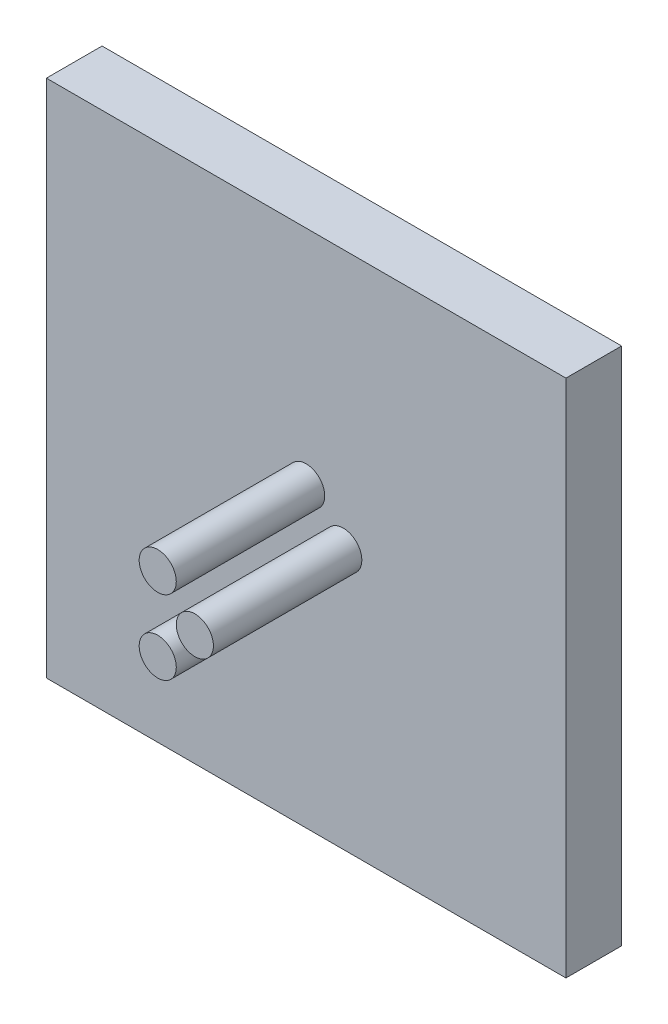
ISO-10303-21;
HEADER;
FILE_DESCRIPTION(('STEP AP214'),'2;1');
FILE_NAME('part.step','',(''),(''),'','','');
FILE_SCHEMA(('AUTOMOTIVE_DESIGN { 1 0 10303 214 1 1 1 1 }'));
ENDSEC;
DATA;
#1=APPLICATION_CONTEXT('core data for automotive mechanical design processes');
#2=APPLICATION_PROTOCOL_DEFINITION('international standard','automotive_design',2000,#1);
#3=PRODUCT_CONTEXT('',#1,'mechanical');
#4=PRODUCT('Part','Part','',(#3));
#5=PRODUCT_RELATED_PRODUCT_CATEGORY('part','',(#4));
#6=PRODUCT_DEFINITION_FORMATION('','',#4);
#7=PRODUCT_DEFINITION_CONTEXT('part definition',#1,'design');
#8=PRODUCT_DEFINITION('design','',#6,#7);
#9=PRODUCT_DEFINITION_SHAPE('','',#8);
#10=(LENGTH_UNIT() NAMED_UNIT(*) SI_UNIT(.MILLI.,.METRE.));
#11=(NAMED_UNIT(*) PLANE_ANGLE_UNIT() SI_UNIT($,.RADIAN.));
#12=(NAMED_UNIT(*) SI_UNIT($,.STERADIAN.) SOLID_ANGLE_UNIT());
#13=UNCERTAINTY_MEASURE_WITH_UNIT(LENGTH_MEASURE(1.E-05),#10,'distance_accuracy_value','');
#14=(GEOMETRIC_REPRESENTATION_CONTEXT(3) GLOBAL_UNCERTAINTY_ASSIGNED_CONTEXT((#13)) GLOBAL_UNIT_ASSIGNED_CONTEXT((#10,
#11,#12)) REPRESENTATION_CONTEXT('',''));
#15=CARTESIAN_POINT('',(0.,0.,0.));
#16=DIRECTION('',(0.,0.,1.));
#17=DIRECTION('',(1.,0.,0.));
#18=AXIS2_PLACEMENT_3D('',#15,#16,#17);
#19=CARTESIAN_POINT('',(-7.,-7.,1.5));
#20=DIRECTION('',(0.,0.,1.));
#21=DIRECTION('',(1.,0.,0.));
#22=AXIS2_PLACEMENT_3D('',#19,#20,#21);
#23=PLANE('',#22);
#24=CARTESIAN_POINT('',(1.,0.,1.5));
#25=DIRECTION('',(0.,0.,1.));
#26=DIRECTION('',(1.,0.,0.));
#27=AXIS2_PLACEMENT_3D('',#24,#25,#26);
#28=CIRCLE('',#27,0.5);
#29=CARTESIAN_POINT('',(1.5,0.,1.5));
#30=VERTEX_POINT('',#29);
#31=EDGE_CURVE('E121',#30,#30,#28,.T.);
#32=ORIENTED_EDGE('',*,*,#31,.F.);
#33=EDGE_LOOP('',(#32));
#34=FACE_BOUND('',#33,.T.);
#35=DIRECTION('',(0.,-1.,0.));
#36=VECTOR('',#35,1.);
#37=CARTESIAN_POINT('',(-7.,7.,1.5));
#38=LINE('',#37,#36);
#39=CARTESIAN_POINT('',(-7.,7.,1.5));
#40=VERTEX_POINT('',#39);
#41=CARTESIAN_POINT('',(-7.,-7.,1.5));
#42=VERTEX_POINT('',#41);
#43=EDGE_CURVE('E95',#40,#42,#38,.T.);
#44=ORIENTED_EDGE('',*,*,#43,.T.);
#45=DIRECTION('',(1.,0.,0.));
#46=VECTOR('',#45,1.);
#47=CARTESIAN_POINT('',(-7.,-7.,1.5));
#48=LINE('',#47,#46);
#49=CARTESIAN_POINT('',(7.,-7.,1.5));
#50=VERTEX_POINT('',#49);
#51=EDGE_CURVE('E80',#42,#50,#48,.T.);
#52=ORIENTED_EDGE('',*,*,#51,.T.);
#53=DIRECTION('',(0.,1.,0.));
#54=VECTOR('',#53,1.);
#55=CARTESIAN_POINT('',(7.,7.,1.5));
#56=LINE('',#55,#54);
#57=CARTESIAN_POINT('',(7.,7.,1.5));
#58=VERTEX_POINT('',#57);
#59=EDGE_CURVE('E47',#50,#58,#56,.T.);
#60=ORIENTED_EDGE('',*,*,#59,.T.);
#61=DIRECTION('',(-1.,0.,0.));
#62=VECTOR('',#61,1.);
#63=CARTESIAN_POINT('',(-7.,7.,1.5));
#64=LINE('',#63,#62);
#65=EDGE_CURVE('E42',#58,#40,#64,.T.);
#66=ORIENTED_EDGE('',*,*,#65,.T.);
#67=EDGE_LOOP('',(#44,#52,#60,#66));
#68=FACE_BOUND('',#67,.T.);
#69=CARTESIAN_POINT('',(0.,1.,1.5));
#70=DIRECTION('',(0.,0.,1.));
#71=DIRECTION('',(1.,0.,0.));
#72=AXIS2_PLACEMENT_3D('',#69,#70,#71);
#73=CIRCLE('',#72,0.5);
#74=CARTESIAN_POINT('',(0.5,1.,1.5));
#75=VERTEX_POINT('',#74);
#76=EDGE_CURVE('E88',#75,#75,#73,.T.);
#77=ORIENTED_EDGE('',*,*,#76,.F.);
#78=EDGE_LOOP('',(#77));
#79=FACE_BOUND('',#78,.T.);
#80=CARTESIAN_POINT('',(0.,-1.,1.5));
#81=DIRECTION('',(0.,0.,1.));
#82=DIRECTION('',(1.,0.,0.));
#83=AXIS2_PLACEMENT_3D('',#80,#81,#82);
#84=CIRCLE('',#83,0.5);
#85=CARTESIAN_POINT('',(0.5,-1.,1.5));
#86=VERTEX_POINT('',#85);
#87=EDGE_CURVE('E116',#86,#86,#84,.T.);
#88=ORIENTED_EDGE('',*,*,#87,.F.);
#89=EDGE_LOOP('',(#88));
#90=FACE_BOUND('',#89,.T.);
#91=ADVANCED_FACE('F27',(#34,#68,#79,#90),#23,.T.);
#92=CARTESIAN_POINT('',(-7.,7.,1.5));
#93=DIRECTION('',(1.,0.,0.));
#94=DIRECTION('',(0.,1.,0.));
#95=AXIS2_PLACEMENT_3D('',#92,#93,#94);
#96=PLANE('',#95);
#97=DIRECTION('',(0.,-1.,0.));
#98=VECTOR('',#97,1.);
#99=CARTESIAN_POINT('',(-7.,7.,0.));
#100=LINE('',#99,#98);
#101=CARTESIAN_POINT('',(-7.,7.,0.));
#102=VERTEX_POINT('',#101);
#103=CARTESIAN_POINT('',(-7.,-7.,0.));
#104=VERTEX_POINT('',#103);
#105=EDGE_CURVE('E72',#102,#104,#100,.T.);
#106=ORIENTED_EDGE('',*,*,#105,.T.);
#107=DIRECTION('',(0.,0.,-1.));
#108=VECTOR('',#107,1.);
#109=CARTESIAN_POINT('',(-7.,-7.,1.5));
#110=LINE('',#109,#108);
#111=EDGE_CURVE('E11',#42,#104,#110,.T.);
#112=ORIENTED_EDGE('',*,*,#111,.F.);
#113=ORIENTED_EDGE('',*,*,#43,.F.);
#114=DIRECTION('',(0.,0.,-1.));
#115=VECTOR('',#114,1.);
#116=CARTESIAN_POINT('',(-7.,7.,1.5));
#117=LINE('',#116,#115);
#118=EDGE_CURVE('E84',#40,#102,#117,.T.);
#119=ORIENTED_EDGE('',*,*,#118,.T.);
#120=EDGE_LOOP('',(#106,#112,#113,#119));
#121=FACE_BOUND('',#120,.T.);
#122=ADVANCED_FACE('F29',(#121),#96,.F.);
#123=CARTESIAN_POINT('',(-7.,-7.,1.5));
#124=DIRECTION('',(0.,1.,0.));
#125=DIRECTION('',(0.,0.,1.));
#126=AXIS2_PLACEMENT_3D('',#123,#124,#125);
#127=PLANE('',#126);
#128=DIRECTION('',(1.,0.,0.));
#129=VECTOR('',#128,1.);
#130=CARTESIAN_POINT('',(-7.,-7.,0.));
#131=LINE('',#130,#129);
#132=CARTESIAN_POINT('',(7.,-7.,0.));
#133=VERTEX_POINT('',#132);
#134=EDGE_CURVE('E68',#104,#133,#131,.T.);
#135=ORIENTED_EDGE('',*,*,#134,.T.);
#136=DIRECTION('',(0.,0.,-1.));
#137=VECTOR('',#136,1.);
#138=CARTESIAN_POINT('',(7.,-7.,1.5));
#139=LINE('',#138,#137);
#140=EDGE_CURVE('E35',#50,#133,#139,.T.);
#141=ORIENTED_EDGE('',*,*,#140,.F.);
#142=ORIENTED_EDGE('',*,*,#51,.F.);
#143=ORIENTED_EDGE('',*,*,#111,.T.);
#144=EDGE_LOOP('',(#135,#141,#142,#143));
#145=FACE_BOUND('',#144,.T.);
#146=ADVANCED_FACE('F79',(#145),#127,.F.);
#147=CARTESIAN_POINT('',(7.,7.,1.5));
#148=DIRECTION('',(-1.,0.,0.));
#149=DIRECTION('',(0.,-1.,0.));
#150=AXIS2_PLACEMENT_3D('',#147,#148,#149);
#151=PLANE('',#150);
#152=DIRECTION('',(0.,1.,0.));
#153=VECTOR('',#152,1.);
#154=CARTESIAN_POINT('',(7.,7.,0.));
#155=LINE('',#154,#153);
#156=CARTESIAN_POINT('',(7.,7.,0.));
#157=VERTEX_POINT('',#156);
#158=EDGE_CURVE('E73',#133,#157,#155,.T.);
#159=ORIENTED_EDGE('',*,*,#158,.T.);
#160=DIRECTION('',(0.,0.,-1.));
#161=VECTOR('',#160,1.);
#162=CARTESIAN_POINT('',(7.,7.,1.5));
#163=LINE('',#162,#161);
#164=EDGE_CURVE('E101',#58,#157,#163,.T.);
#165=ORIENTED_EDGE('',*,*,#164,.F.);
#166=ORIENTED_EDGE('',*,*,#59,.F.);
#167=ORIENTED_EDGE('',*,*,#140,.T.);
#168=EDGE_LOOP('',(#159,#165,#166,#167));
#169=FACE_BOUND('',#168,.T.);
#170=ADVANCED_FACE('F104',(#169),#151,.F.);
#171=CARTESIAN_POINT('',(-7.,7.,1.5));
#172=DIRECTION('',(0.,-1.,0.));
#173=DIRECTION('',(0.,0.,-1.));
#174=AXIS2_PLACEMENT_3D('',#171,#172,#173);
#175=PLANE('',#174);
#176=DIRECTION('',(-1.,0.,0.));
#177=VECTOR('',#176,1.);
#178=CARTESIAN_POINT('',(-7.,7.,0.));
#179=LINE('',#178,#177);
#180=EDGE_CURVE('E93',#157,#102,#179,.T.);
#181=ORIENTED_EDGE('',*,*,#180,.T.);
#182=ORIENTED_EDGE('',*,*,#118,.F.);
#183=ORIENTED_EDGE('',*,*,#65,.F.);
#184=ORIENTED_EDGE('',*,*,#164,.T.);
#185=EDGE_LOOP('',(#181,#182,#183,#184));
#186=FACE_BOUND('',#185,.T.);
#187=ADVANCED_FACE('F106',(#186),#175,.F.);
#188=CARTESIAN_POINT('',(-7.,-7.,0.));
#189=DIRECTION('',(0.,0.,1.));
#190=DIRECTION('',(1.,0.,0.));
#191=AXIS2_PLACEMENT_3D('',#188,#189,#190);
#192=PLANE('',#191);
#193=ORIENTED_EDGE('',*,*,#105,.F.);
#194=ORIENTED_EDGE('',*,*,#180,.F.);
#195=ORIENTED_EDGE('',*,*,#158,.F.);
#196=ORIENTED_EDGE('',*,*,#134,.F.);
#197=EDGE_LOOP('',(#193,#194,#195,#196));
#198=FACE_BOUND('',#197,.T.);
#199=ADVANCED_FACE('F69',(#198),#192,.F.);
#200=CARTESIAN_POINT('',(0.,1.,5.5));
#201=DIRECTION('',(0.,0.,-1.));
#202=DIRECTION('',(-1.,0.,0.));
#203=AXIS2_PLACEMENT_3D('',#200,#201,#202);
#204=CYLINDRICAL_SURFACE('',#203,0.5);
#205=CARTESIAN_POINT('',(0.,1.,5.5));
#206=DIRECTION('',(0.,0.,1.));
#207=DIRECTION('',(1.,0.,0.));
#208=AXIS2_PLACEMENT_3D('',#205,#206,#207);
#209=CIRCLE('',#208,0.5);
#210=CARTESIAN_POINT('',(0.5,1.,5.5));
#211=VERTEX_POINT('',#210);
#212=EDGE_CURVE('E85',#211,#211,#209,.T.);
#213=ORIENTED_EDGE('',*,*,#212,.F.);
#214=EDGE_LOOP('',(#213));
#215=FACE_BOUND('',#214,.T.);
#216=ORIENTED_EDGE('',*,*,#76,.T.);
#217=EDGE_LOOP('',(#216));
#218=FACE_BOUND('',#217,.T.);
#219=ADVANCED_FACE('F129',(#215,#218),#204,.T.);
#220=CARTESIAN_POINT('',(0.,1.,5.5));
#221=DIRECTION('',(0.,0.,1.));
#222=DIRECTION('',(1.,0.,0.));
#223=AXIS2_PLACEMENT_3D('',#220,#221,#222);
#224=PLANE('',#223);
#225=ORIENTED_EDGE('',*,*,#212,.T.);
#226=EDGE_LOOP('',(#225));
#227=FACE_BOUND('',#226,.T.);
#228=ADVANCED_FACE('F131',(#227),#224,.T.);
#229=CARTESIAN_POINT('',(1.,0.,5.5));
#230=DIRECTION('',(0.,0.,-1.));
#231=DIRECTION('',(-1.,0.,0.));
#232=AXIS2_PLACEMENT_3D('',#229,#230,#231);
#233=CYLINDRICAL_SURFACE('',#232,0.5);
#234=CARTESIAN_POINT('',(1.,0.,5.5));
#235=DIRECTION('',(0.,0.,1.));
#236=DIRECTION('',(1.,0.,0.));
#237=AXIS2_PLACEMENT_3D('',#234,#235,#236);
#238=CIRCLE('',#237,0.5);
#239=CARTESIAN_POINT('',(1.5,0.,5.5));
#240=VERTEX_POINT('',#239);
#241=EDGE_CURVE('E126',#240,#240,#238,.T.);
#242=ORIENTED_EDGE('',*,*,#241,.F.);
#243=EDGE_LOOP('',(#242));
#244=FACE_BOUND('',#243,.T.);
#245=ORIENTED_EDGE('',*,*,#31,.T.);
#246=EDGE_LOOP('',(#245));
#247=FACE_BOUND('',#246,.T.);
#248=ADVANCED_FACE('F137',(#244,#247),#233,.T.);
#249=CARTESIAN_POINT('',(1.,0.,5.5));
#250=DIRECTION('',(0.,0.,1.));
#251=DIRECTION('',(1.,0.,0.));
#252=AXIS2_PLACEMENT_3D('',#249,#250,#251);
#253=PLANE('',#252);
#254=ORIENTED_EDGE('',*,*,#241,.T.);
#255=EDGE_LOOP('',(#254));
#256=FACE_BOUND('',#255,.T.);
#257=ADVANCED_FACE('F185',(#256),#253,.T.);
#258=CARTESIAN_POINT('',(0.,-1.,5.5));
#259=DIRECTION('',(0.,0.,-1.));
#260=DIRECTION('',(-1.,0.,0.));
#261=AXIS2_PLACEMENT_3D('',#258,#259,#260);
#262=CYLINDRICAL_SURFACE('',#261,0.5);
#263=CARTESIAN_POINT('',(0.,-1.,5.5));
#264=DIRECTION('',(0.,0.,1.));
#265=DIRECTION('',(1.,0.,0.));
#266=AXIS2_PLACEMENT_3D('',#263,#264,#265);
#267=CIRCLE('',#266,0.5);
#268=CARTESIAN_POINT('',(0.5,-1.,5.5));
#269=VERTEX_POINT('',#268);
#270=EDGE_CURVE('E118',#269,#269,#267,.T.);
#271=ORIENTED_EDGE('',*,*,#270,.F.);
#272=EDGE_LOOP('',(#271));
#273=FACE_BOUND('',#272,.T.);
#274=ORIENTED_EDGE('',*,*,#87,.T.);
#275=EDGE_LOOP('',(#274));
#276=FACE_BOUND('',#275,.T.);
#277=ADVANCED_FACE('F192',(#273,#276),#262,.T.);
#278=CARTESIAN_POINT('',(0.,-1.,5.5));
#279=DIRECTION('',(0.,0.,1.));
#280=DIRECTION('',(1.,0.,0.));
#281=AXIS2_PLACEMENT_3D('',#278,#279,#280);
#282=PLANE('',#281);
#283=ORIENTED_EDGE('',*,*,#270,.T.);
#284=EDGE_LOOP('',(#283));
#285=FACE_BOUND('',#284,.T.);
#286=ADVANCED_FACE('F200',(#285),#282,.T.);
#287=CLOSED_SHELL('',(#91,#122,#146,#170,#187,#199,#219,#228,#248,#257,#277,#286));
#288=MANIFOLD_SOLID_BREP('B2',#287);
#289=ADVANCED_BREP_SHAPE_REPRESENTATION('',(#18,#288),#14);
#290=SHAPE_DEFINITION_REPRESENTATION(#9,#289);
ENDSEC;
END-ISO-10303-21;
